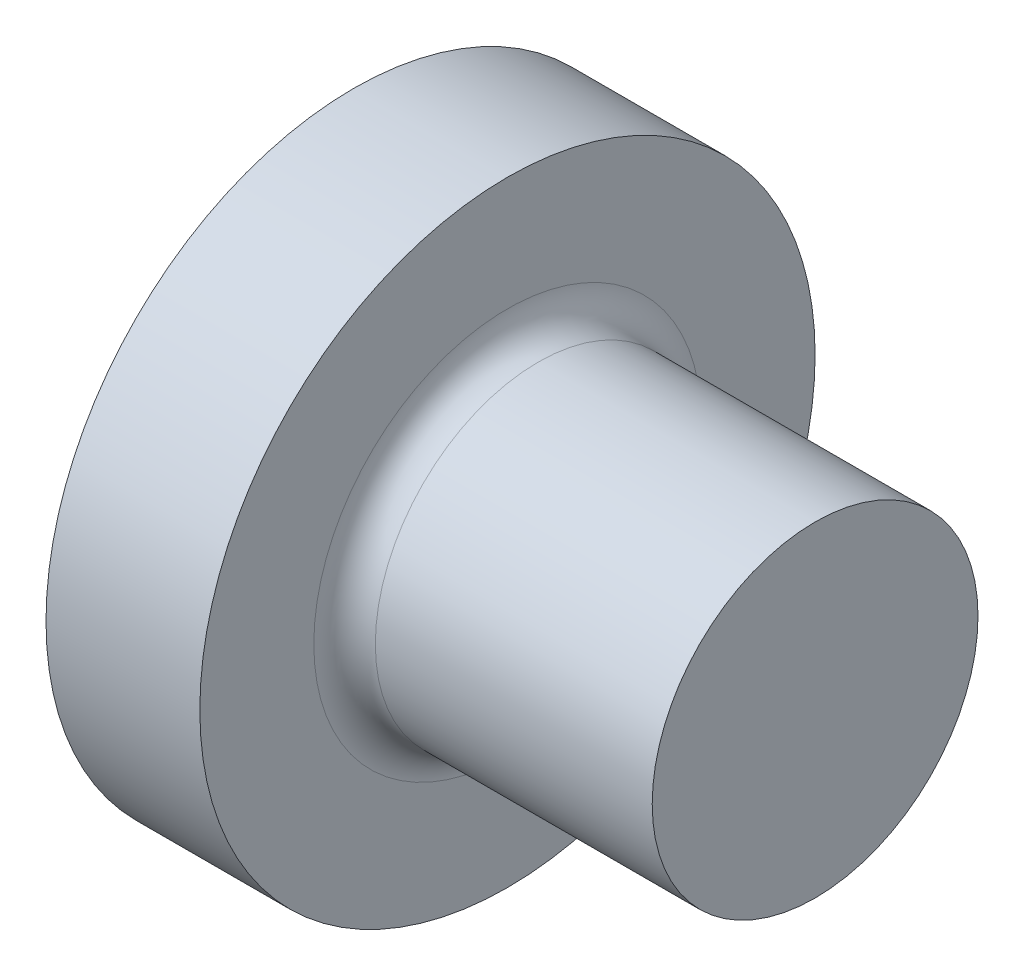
from build123d import *


with BuildPart() as part:
    # Sketch1 → Revolve1 (revolve)
    with BuildSketch(Plane.XY, mode=Mode.PRIVATE) as revolve1_sk:
        with BuildLine():
            Line((0, 0.749667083), (0, 13.449667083))
            Line((0, 13.449667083), (-22.86, 13.449667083))
            ThreePointArc((-22.86, 13.449667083), (-24.656051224, 14.193615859), (-25.4, 15.989667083))
            Line((-25.4, 15.989667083), (-25.4, 25.4))
            Line((-25.4, 25.4), (-38.1, 25.4))
            Line((-38.1, 25.4), (-38.1, 0))
            Line((-38.1, 0), (0, 0))
            Line((0, 0), (0, 0.749667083))
        make_face()
    revolve(revolve1_sk.sketch.rotate(Axis((52.510934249, 0, 0), (-1, 0, 0)), 90), axis=Axis((52.510934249, 0, 0), (-1, 0, 0)))


solid = part.part
